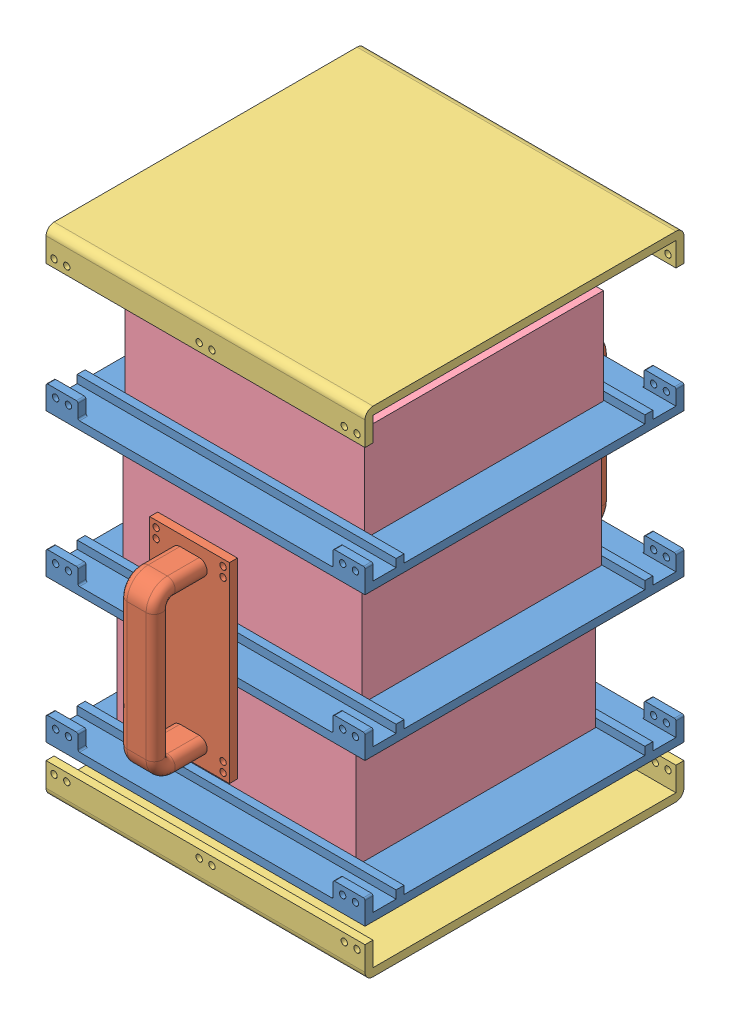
SolidWorks assembly Assem1.SLDASM, configuration Default (file format 15000). Lengths in mm.
Overall size (200 310 286.52).
12 component instances, 5 part files, 29 mates.
Components (placement in the parent):
- Wall-1: Wall.SLDPRT [Default] at (-144.2322 167.9421 357.7411) size (200 300 5)
- Wall-3: Wall.SLDPRT [Default] at (-144.2322 167.9421 152.7411) size (200 300 5)
- Stack WIP-1: Stack WIP.SLDPRT [Default] at (-144.2322 227.9421 257.7411) x (0 0 -1) z (1 0 0) size (200 15 200)
- Stack WIP-2: Stack WIP.SLDPRT [Default] at (-144.2322 137.9421 257.7411) x (0 0 -1) z (1 0 0) size (200 15 200)
- Stack WIP-3: Stack WIP.SLDPRT [Default] at (-144.2322 47.9421 257.7411) x (0 0 -1) z (1 0 0) size (200 15 200)
- handle-1: handle.SLDPRT [Default] at (-144.2322 147.9421 152.7411) x (0 -1 0) z (1 0 0) size (120 38.26 50)
- handle-2: handle.SLDPRT [Default] at (-144.2322 147.9421 362.7411) x (0 -1 0) z (-1 0 0) size (120 38.26 50)
- Top wall-1: Top wall.SLDPRT [Default] at (-144.2322 322.9421 257.7411) x (0 0 1) z (0 -1 0) size (200 200 20)
- Top wall-2: Top wall.SLDPRT [Default] at (-144.2322 12.9421 257.7411) x (0 0 1) z (0 1 0) size (200 200 20)
- WIP-1: WIP.SLDPRT [Default] at (-144.6923 227.9421 257.7411) size (150 60 150)
- WIP-2: WIP.SLDPRT [Default] at (-146.042 137.9421 257.7411) size (150 60 150)
- WIP-3: WIP.SLDPRT [Default] at (-149.7865 47.9421 257.7411) size (150 60 150)
Mates (geometry in assembly coordinates):
- Coincident1: coincident anti-aligned: plane of Wall-3 through (-144.2322 167.9421 157.7411) normal (0 0 1); plane of Stack WIP-1 through (-44.2322 222.9421 157.7411) normal (0 0 -1)
- Concentric2: concentric anti-aligned: cylinder of Wall-3 through (-238.2322 232.9421 152.7411) axis (0 0 1) radius 2; cylinder of Stack WIP-1 through (-238.2322 232.9421 167.7411) axis (0 0 -1) radius 2
- Coincident2: coincident anti-aligned: plane of Wall-1 through (-144.2322 167.9421 357.7411) normal (0 0 -1); plane of Stack WIP-1 through (-44.2322 222.9421 357.7411) normal (0 0 1)
- Concentric3: concentric aligned: cylinder of Wall-1 through (-238.2322 232.9421 357.7411) axis (0 0 1) radius 2; cylinder of Stack WIP-1 through (-238.2322 232.9421 347.7411) axis (0 0 1) radius 2
- Coincident3: coincident anti-aligned: plane of Wall-3 through (-144.2322 167.9421 157.7411) normal (0 0 1); plane of Stack WIP-2 through (-44.2322 132.9421 157.7411) normal (0 0 -1)
- Concentric6: concentric anti-aligned: cylinder of Wall-3 through (-238.2322 142.9421 152.7411) axis (0 0 1) radius 2; cylinder of Stack WIP-2 through (-238.2322 142.9421 167.7411) axis (0 0 -1) radius 2
- Coincident4: coincident anti-aligned: plane of Wall-1 through (-144.2322 167.9421 357.7411) normal (0 0 -1); plane of Stack WIP-3 through (-44.2322 42.9421 357.7411) normal (0 0 1)
- Concentric8: concentric aligned: cylinder of Wall-1 through (-238.2322 52.9421 357.7411) axis (0 0 1) radius 2; cylinder of Stack WIP-3 through (-238.2322 52.9421 347.7411) axis (0 0 1) radius 2
- Coincident5: coincident anti-aligned: plane of Wall-3 through (-144.2322 167.9421 152.7411) normal (0 0 -1); plane of handle-1 through (-144.2322 147.9421 152.7411) normal (0 0 1)
- Concentric9: concentric anti-aligned: cylinder of Wall-3 through (-123.2322 203.9421 152.7411) axis (0 0 1) radius 2; cylinder of handle-1 through (-123.2322 203.9421 152.7411) axis (0 0 -1) radius 2
- Concentric10: concentric anti-aligned: cylinder of Wall-3 through (-123.2322 197.9421 152.7411) axis (0 0 1) radius 2; cylinder of handle-1 through (-123.2322 197.9421 152.7411) axis (0 0 -1) radius 2
- Coincident6: coincident anti-aligned: plane of Wall-1 through (-144.2322 167.9421 362.7411) normal (0 0 1); plane of handle-2 through (-144.2322 147.9421 362.7411) normal (0 0 -1)
- Concentric11: concentric aligned: cylinder of Wall-1 through (-123.2322 203.9421 357.7411) axis (0 0 1) radius 2; cylinder of handle-2 through (-123.2322 203.9421 362.7411) axis (0 0 1) radius 2
- Concentric12: concentric aligned: cylinder of Wall-1 through (-123.2322 197.9421 357.7411) axis (0 0 1) radius 2; cylinder of handle-2 through (-123.2322 197.9421 362.7411) axis (0 0 1) radius 2
- Concentric13: concentric aligned: cylinder of Wall-1 through (-50.2322 142.9421 357.7411) axis (0 0 1) radius 2; cylinder of Stack WIP-2 through (-50.2322 142.9421 347.7411) axis (0 0 1) radius 2
- Concentric14: concentric aligned: cylinder of Wall-1 through (-50.2322 232.9421 357.7411) axis (0 0 1) radius 2; cylinder of Stack WIP-1 through (-50.2322 232.9421 347.7411) axis (0 0 1) radius 2
- Concentric15: concentric aligned: cylinder of Wall-1 through (-50.2322 52.9421 357.7411) axis (0 0 1) radius 2; cylinder of Stack WIP-3 through (-50.2322 52.9421 347.7411) axis (0 0 1) radius 2
- Coincident7: coincident anti-aligned: plane of Wall-1 through (-144.2322 167.9421 357.7411) normal (0 0 -1); plane of Top wall-1 through (-244.2322 317.9421 357.7411) normal (0 0 1)
- Concentric16: concentric anti-aligned: cylinder of Wall-1 through (-239.2322 307.9421 148.7411) axis (0 0 1) radius 2; cylinder of Top wall-1 through (-239.2322 307.9421 371.7411) axis (0 0 -1) radius 2
- Concentric17: concentric anti-aligned: cylinder of Wall-1 through (-231.2322 307.9421 148.7411) axis (0 0 1) radius 2; cylinder of Top wall-1 through (-231.2322 307.9421 371.7411) axis (0 0 -1) radius 2
- Concentric18: concentric anti-aligned: cylinder of Wall-3 through (-49.2322 27.9421 -56.2589) axis (0 0 1) radius 2; cylinder of Top wall-2 through (-49.2322 27.9421 371.7411) axis (0 0 -1) radius 2
- Concentric19: concentric anti-aligned: cylinder of Wall-3 through (-239.2322 27.9421 -56.2589) axis (0 0 1) radius 2; cylinder of Top wall-2 through (-239.2322 27.9421 371.7411) axis (0 0 -1) radius 2
- Coincident8: coincident anti-aligned: plane of Wall-3 through (-144.2322 167.9421 157.7411) normal (0 0 1); plane of Top wall-2 through (-44.2322 17.9421 157.7411) normal (0 0 -1)
- Coincident9: coincident anti-aligned: plane of Stack WIP-1 through (-44.2322 227.9421 357.7411) normal (0 1 0); plane of WIP-1 through (-144.6923 227.9421 257.7411) normal (0 -1 0)
- Width1: width aligned: plane of WIP-1 through (-219.6923 287.9421 182.7411) normal (0 0 -1); plane of WIP-1 through (-219.6923 287.9421 332.7411) normal (0 0 1); plane of Stack WIP-1 through (-244.2322 232.9421 333.2411) normal (0 0 -1); plane of Stack WIP-1 through (-244.2322 232.9421 182.2411) normal (0 0 1)
- Coincident10: coincident anti-aligned: plane of Stack WIP-2 through (-44.2322 137.9421 357.7411) normal (0 1 0); plane of WIP-2 through (-146.042 137.9421 257.7411) normal (0 -1 0)
- Coincident11: coincident anti-aligned: plane of Stack WIP-3 through (-44.2322 47.9421 357.7411) normal (0 1 0); plane of WIP-3 through (-149.7865 47.9421 257.7411) normal (0 -1 0)
- Width2: width aligned: plane of WIP-2 through (-221.042 197.9421 182.7411) normal (0 0 -1); plane of WIP-2 through (-221.042 197.9421 332.7411) normal (0 0 1); plane of Stack WIP-2 through (-244.2322 142.9421 333.2411) normal (0 0 -1); plane of Stack WIP-2 through (-244.2322 142.9421 182.2411) normal (0 0 1)
- Width3: width aligned: plane of WIP-3 through (-224.7865 107.9421 182.7411) normal (0 0 -1); plane of WIP-3 through (-224.7865 107.9421 332.7411) normal (0 0 1); plane of Stack WIP-3 through (-244.2322 52.9421 333.2411) normal (0 0 -1); plane of Stack WIP-3 through (-244.2322 52.9421 182.2411) normal (0 0 1)
